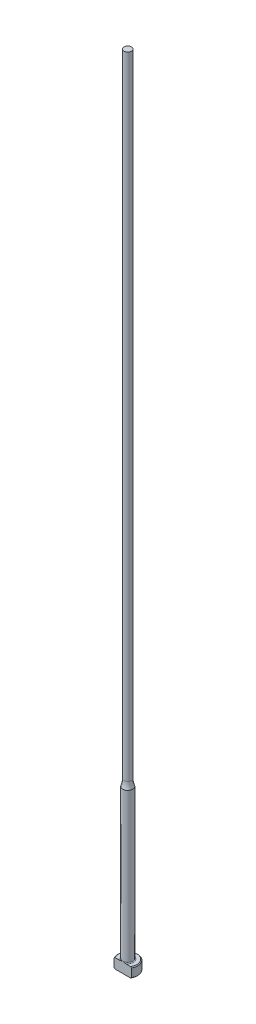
from build123d import *

# Parameters (mm, degrees)
CHAMFER1_SIZE      = 0.254
FILLET1_R          = 0.254
CUT_EXTRUDE1_DEPTH = 255.0396844


with BuildPart() as part:
    # Sketch1 → Revolve1 (revolve)
    with BuildSketch(Plane.XY, mode=Mode.PRIVATE) as revolve1_sk:
        with BuildLine():
            Line((0, 0), (-3.175, 0))
            Line((-3.175, 0), (-3.175, 3.175))
            Line((-3.175, 3.175), (-1.5875, 3.175))
            Line((-1.5875, 3.175), (-1.5875, 50.8))
            ThreePointArc((-1.5875, 50.8), (-1.290157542, 51.887986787), (-1.18999, 53.011416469))
            Line((-1.18999, 53.011416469), (-1.18999, 254))
            Line((-1.18999, 254), (0, 254))
            Line((0, 254), (0, 0))
        make_face()
    revolve(revolve1_sk.sketch.rotate(Axis((0, 259.958771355, 0), (0, -1, 0)), 270), axis=Axis((0, 259.958771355, 0), (0, -1, 0)))

    # Chamfer1
    chamfer1_edges = [part.edges().sort_by_distance(p)[0] for p in [
        (0, 0, -3.175),
        (0, 3.175, -3.175),
    ]]
    chamfer(chamfer1_edges, length=CHAMFER1_SIZE)

    # Fillet1
    fillet1_edges = [part.edges().sort_by_distance(p)[0] for p in [
        (0, 3.175, -1.5875),
    ]]
    fillet(fillet1_edges, radius=FILLET1_R)

    # Sketch2 → Cut-Extrude1 (cut, through all)
    with BuildSketch(Plane.XZ):
        with BuildLine():
            Line((-2.749630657, 1.5875), (2.749630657, 1.5875))
            ThreePointArc((2.749630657, 1.5875), (0, 3.175), (-2.749630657, 1.5875))
        make_face()
    extrude(amount=-CUT_EXTRUDE1_DEPTH, mode=Mode.SUBTRACT)


solid = part.part
